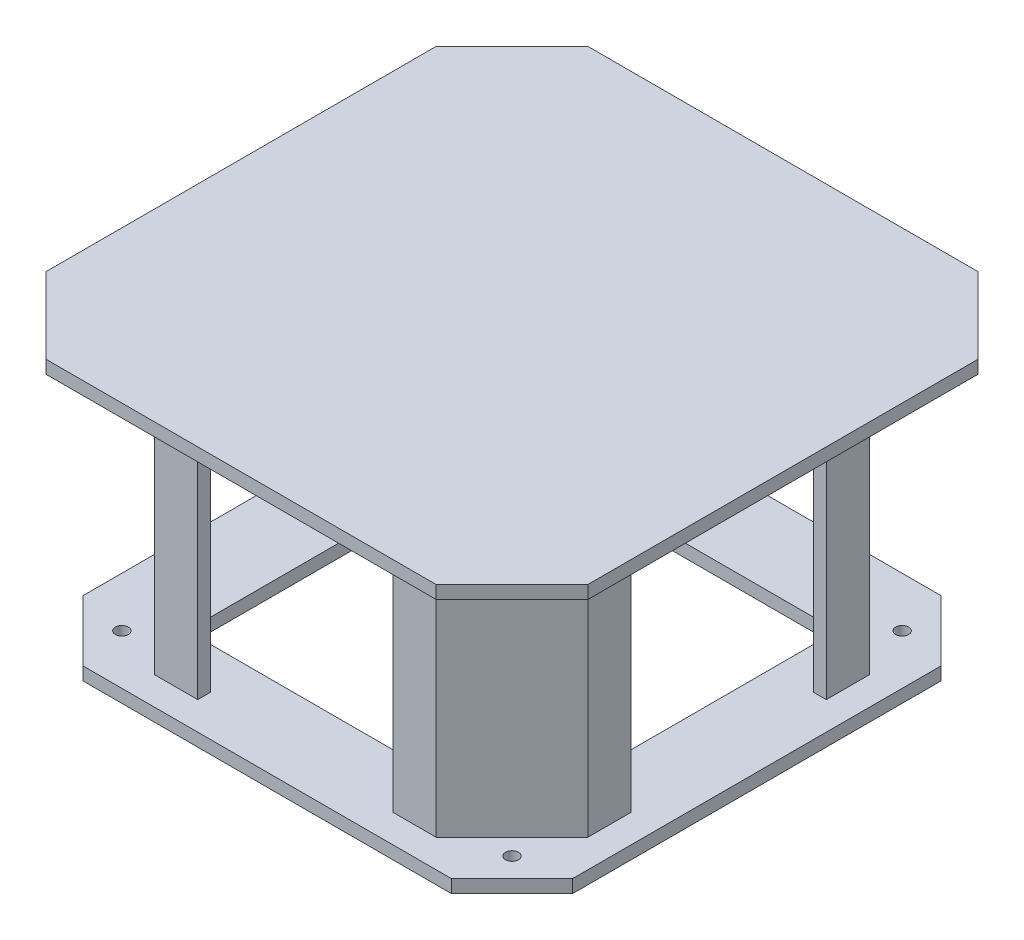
from build123d import *

# Parameters (mm, degrees)
SKETCH1_W           = 250
SKETCH1_H           = 250
BOSS_EXTRUDE1_DEPTH = 6
CHAMFER1_SIZE       = 35
BOSS_EXTRUDE2_DEPTH = 120
BOSS_EXTRUDE3_DEPTH = 6
CUT_EXTRUDE2_REACH  = 222.622
CUT_EXTRUDE3_REACH  = 219.085
SKETCH6_R           = 3


with BuildPart() as part:
    # Sketch1 → Boss-Extrude1 (new body)
    with BuildSketch(Plane(origin=(0, 0, 0), x_dir=(1, 0, 0), z_dir=(0, 1, 0))):
        Rectangle(SKETCH1_W, SKETCH1_H)
    extrude(amount=BOSS_EXTRUDE1_DEPTH)

    # Chamfer1
    chamfer1_edges = [part.edges().sort_by_distance(p)[0] for p in [
        (125, 3, 125),
        (-125, 3, 125),
        (-125, 3, -125),
        (125, 3, -125),
    ]]
    chamfer(chamfer1_edges, length=CHAMFER1_SIZE)

    # Sketch3 → Boss-Extrude2 (add)
    with BuildSketch(Plane.XZ):
        Polygon((-100, 65), (-65, 100), (-45, 100), (-45, 94), (-62.514718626, 94), (-94, 62.514718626), (-94, 45), (-100, 45), align=None)
        Polygon((-65, -100), (-45, -100), (-45, -94), (-62.514718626, -94), (-94, -62.514718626), (-94, -45), (-100, -45), (-100, -65), align=None)
        Polygon((100, -65), (100, -45), (94, -45), (94, -62.514718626), (62.514718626, -94), (45, -94), (45, -100), (65, -100), align=None)
        Polygon((65, 100), (100, 65), (100, 45), (94, 45), (94, 62.514718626), (62.514718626, 94), (45, 94), (45, 100), align=None)
    extrude(amount=BOSS_EXTRUDE2_DEPTH)

    # Sketch4 → Boss-Extrude3 (add)
    with BuildSketch(Plane.XZ.offset(120)):
        Polygon((113, 85.029437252), (85.029437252, 113), (-85.029437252, 113), (-113, 85.029437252), (-113, -85.029437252), (-85.029437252, -113), (85.029437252, -113), (113, -85.029437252), align=None)
    extrude(amount=BOSS_EXTRUDE3_DEPTH)

    # Sketch5 → Cut-Extrude2 (cut, up to next)
    with BuildSketch(Plane.XZ.offset(126), mode=Mode.PRIVATE) as cut_extrude2_sk1:
        Polygon((75, 69.289321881), (69.289321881, 75), (-69.289321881, 75), (-75, 69.289321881), (-75, -69.289321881), (-69.289321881, -75), (69.289321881, -75), (75, -69.289321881), align=None)
    cut_extrude2_tool1 = extrude(cut_extrude2_sk1.sketch, amount=-CUT_EXTRUDE2_REACH, mode=Mode.PRIVATE) & part.part
    add(cut_extrude2_tool1.solids().sort_by_distance((0, -126, 0))[0], mode=Mode.SUBTRACT)

    # Sketch6 → Cut-Extrude3 (cut, up to next)
    with BuildSketch(Plane(origin=(0, -120, 0), x_dir=(1, 0, 0), z_dir=(0, 1, 0)), mode=Mode.PRIVATE) as cut_extrude3_sk1:
        with Locations(Location((-90, -90, 0), (0, 0, 270))):
            Circle(SKETCH6_R)
    cut_extrude3_tool1 = extrude(cut_extrude3_sk1.sketch, amount=-CUT_EXTRUDE3_REACH, mode=Mode.PRIVATE) & part.part
    # Sketch6 → Cut-Extrude3 (cut, up to next)
    with BuildSketch(Plane(origin=(0, -120, 0), x_dir=(1, 0, 0), z_dir=(0, 1, 0)), mode=Mode.PRIVATE) as cut_extrude3_sk2:
        with Locations(Location((90, -90, 0), (0, 0, 270))):
            Circle(SKETCH6_R)
    cut_extrude3_tool2 = extrude(cut_extrude3_sk2.sketch, amount=-CUT_EXTRUDE3_REACH, mode=Mode.PRIVATE) & part.part
    # Sketch6 → Cut-Extrude3 (cut, up to next)
    with BuildSketch(Plane(origin=(0, -120, 0), x_dir=(1, 0, 0), z_dir=(0, 1, 0)), mode=Mode.PRIVATE) as cut_extrude3_sk3:
        with Locations(Location((90, 90, 0), (0, 0, 270))):
            Circle(SKETCH6_R)
    cut_extrude3_tool3 = extrude(cut_extrude3_sk3.sketch, amount=-CUT_EXTRUDE3_REACH, mode=Mode.PRIVATE) & part.part
    # Sketch6 → Cut-Extrude3 (cut, up to next)
    with BuildSketch(Plane(origin=(0, -120, 0), x_dir=(1, 0, 0), z_dir=(0, 1, 0)), mode=Mode.PRIVATE) as cut_extrude3_sk4:
        with Locations(Location((-90, 90, 0), (0, 0, 270))):
            Circle(SKETCH6_R)
    cut_extrude3_tool4 = extrude(cut_extrude3_sk4.sketch, amount=-CUT_EXTRUDE3_REACH, mode=Mode.PRIVATE) & part.part
    add(cut_extrude3_tool1.solids().sort_by_distance((-90, -120, 90))[0], mode=Mode.SUBTRACT)
    add(cut_extrude3_tool2.solids().sort_by_distance((90, -120, 90))[0], mode=Mode.SUBTRACT)
    add(cut_extrude3_tool3.solids().sort_by_distance((90, -120, -90))[0], mode=Mode.SUBTRACT)
    add(cut_extrude3_tool4.solids().sort_by_distance((-90, -120, -90))[0], mode=Mode.SUBTRACT)


solid = part.part
